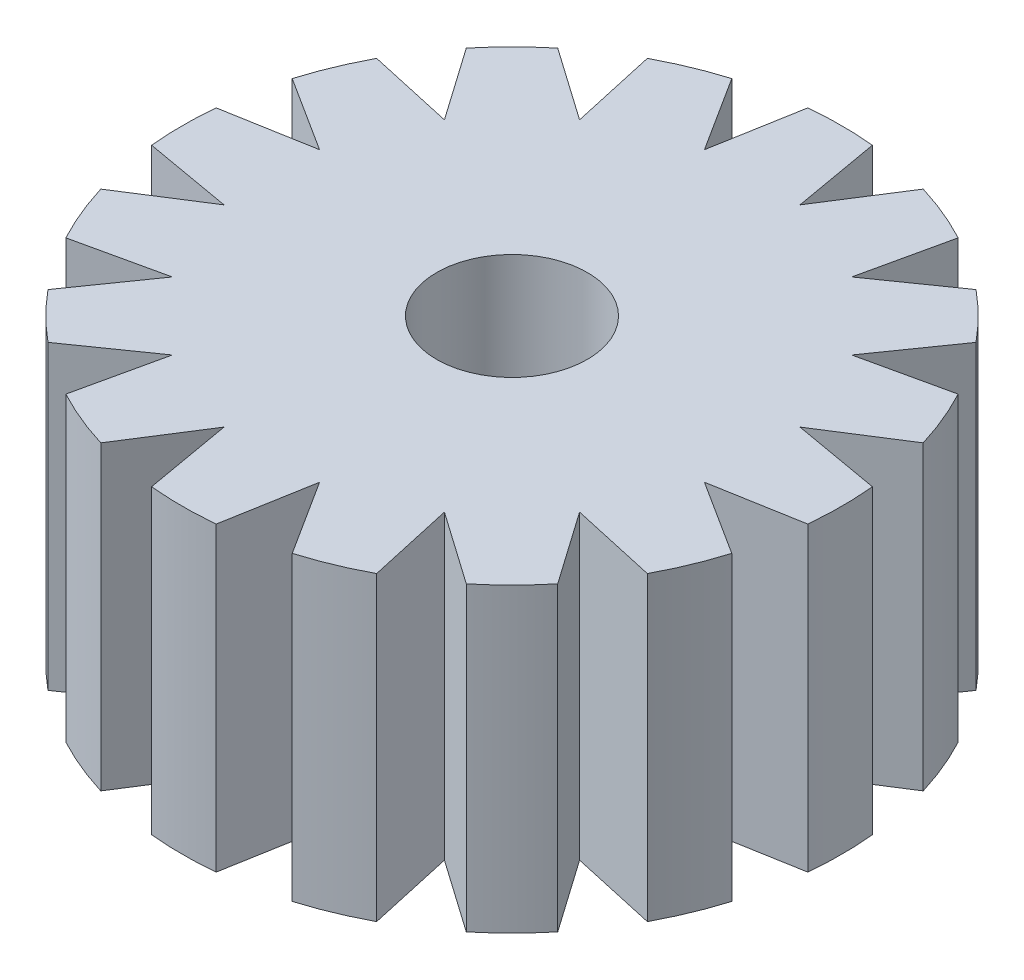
from build123d import *

# Parameters (mm, degrees)
EXTRUDE_1_DEPTH          = 8
PATTERN_CIRCULAR_1_COUNT = 16
SKETCH_2_R               = 2
CUT_EXTRUDE_1_DEPTH      = 17


with BuildPart() as part:
    # Sketch 1 → Extrude 1 (new body)
    with BuildSketch(Plane(origin=(0, 0, 0), x_dir=(1, 0, 0), z_dir=(0, 1, 0))):
        with BuildLine():
            Line((3.611206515, 5.40455248), (4.124721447, 7.716811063))
            ThreePointArc((4.124721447, 7.716811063), (3.348480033, 8.083945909), (2.539990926, 8.373227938))
            Line((2.539990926, 8.373227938), (1.268087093, 6.375104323))
            ThreePointArc((1.268087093, 6.375104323), (-6.007451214, 2.488367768), (-3.611206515, -5.40455248))
            ThreePointArc((-3.611206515, -5.40455248), (5.40455248, -3.611206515), (3.611206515, 5.40455248))
        make_face()
    extrude_1 = extrude(amount=EXTRUDE_1_DEPTH)

    # Pattern Circular 1: Extrude 1 ×16 about axis
    pattern_circular_1_axis = Axis((0, 0, 0), (0, 1, 0))
    for i in range(1, PATTERN_CIRCULAR_1_COUNT):
        add(extrude_1.rotate(pattern_circular_1_axis, i * 360 / PATTERN_CIRCULAR_1_COUNT))

    # Sketch 2 → Cut-Extrude 1 (cut)
    with BuildSketch(Plane(origin=(0, 8, 0), x_dir=(1, 0, 0), z_dir=(0, 1, 0))):
        with Locations(Location((0, 0, 0), (0, 0, 270))):
            Circle(SKETCH_2_R)
    extrude(amount=-CUT_EXTRUDE_1_DEPTH, mode=Mode.SUBTRACT)


solid = part.part
